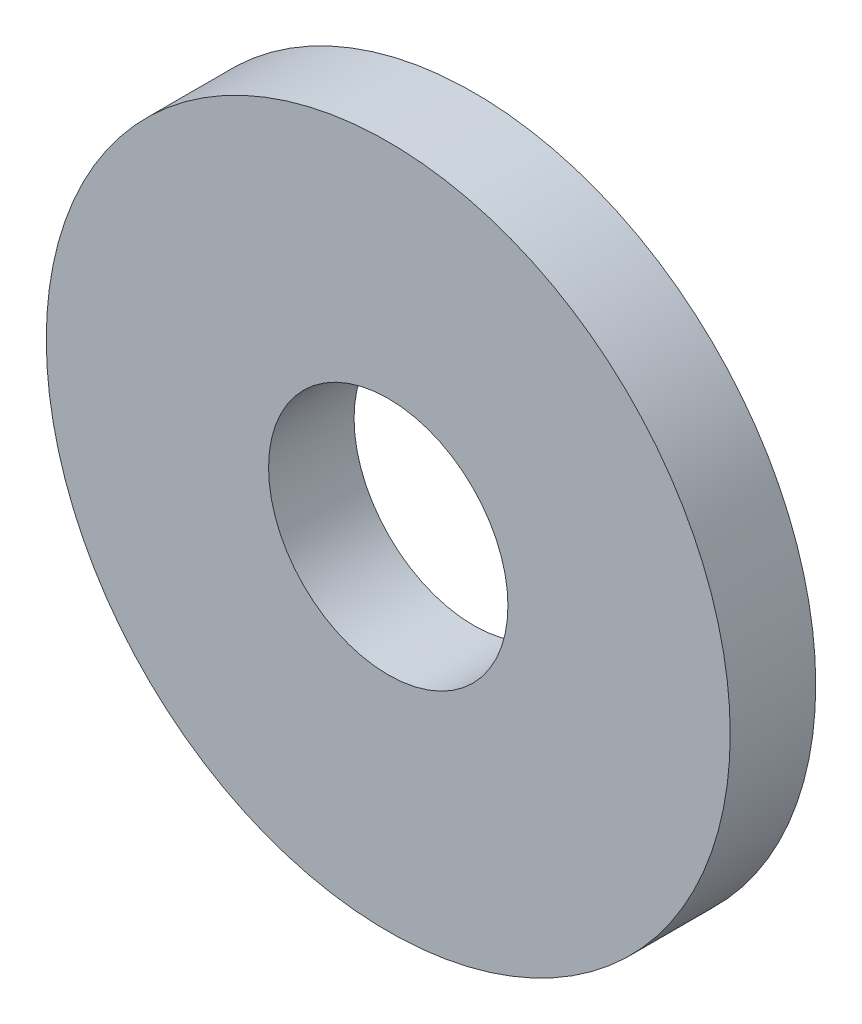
from build123d import *

# Parameters (mm, degrees)
SKETCH1_R              = 20
EXTRUDE_TJOCKLEK_DEPTH = 5
CUT_CENTRUMH_L_REACH   = 30.723
SKETCH2_R              = 7


with BuildPart() as part:
    # Sketch1 → Extrude tjocklek (new body)
    with BuildSketch(Plane.XY):
        Circle(SKETCH1_R)
    extrude(amount=EXTRUDE_TJOCKLEK_DEPTH)

    # Sketch2 → Cut centrumh_l (cut, up to next)
    with BuildSketch(Plane.XY, mode=Mode.PRIVATE) as cut_centrumh_l_sk1:
        Circle(SKETCH2_R)
    cut_centrumh_l_tool1 = extrude(cut_centrumh_l_sk1.sketch, amount=CUT_CENTRUMH_L_REACH, mode=Mode.PRIVATE) & part.part
    add(cut_centrumh_l_tool1.solids().sort_by_distance((0, 0, 0))[0], mode=Mode.SUBTRACT)


solid = part.part
